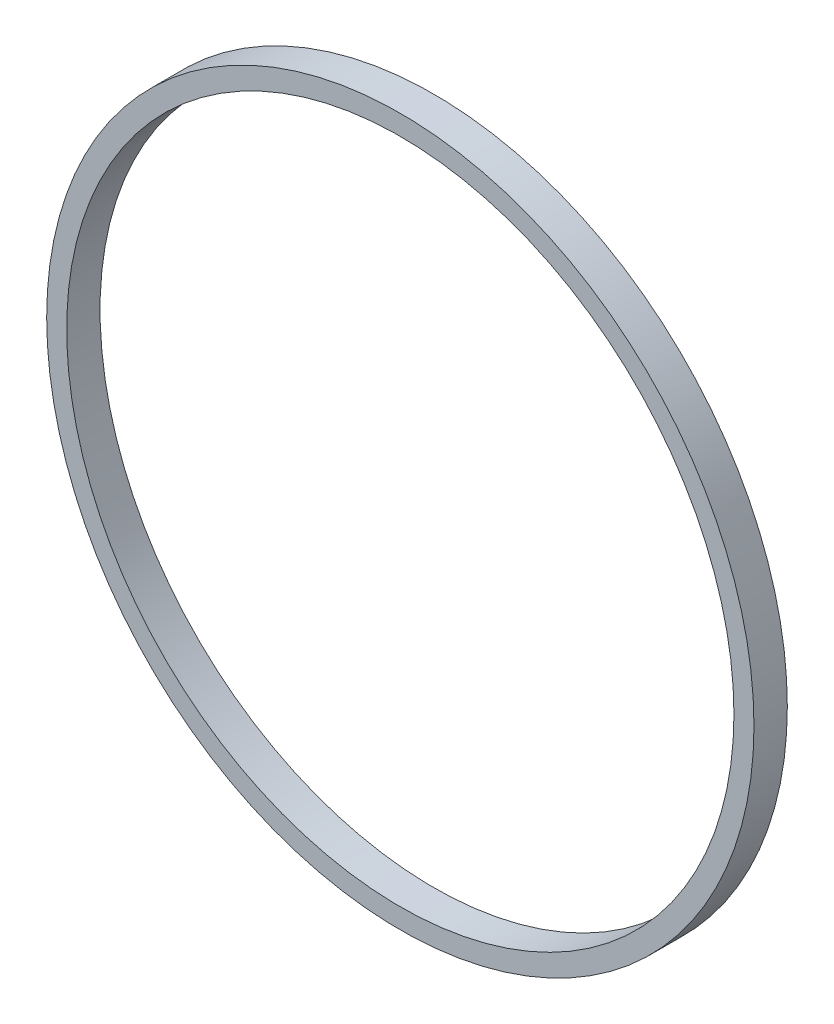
from build123d import *

# Parameters (mm, degrees)
ESQUISSE1_R      = 26.5
ESQUISSE1_R_2    = 25
EXTRUSION1_DEPTH = 2.5


with BuildPart() as part:
    # Esquisse1 → Extrusion1 (new body)
    with BuildSketch(Plane.XY):
        Circle(ESQUISSE1_R)
        Circle(ESQUISSE1_R_2, mode=Mode.SUBTRACT)
    extrude(amount=EXTRUSION1_DEPTH)


solid = part.part
